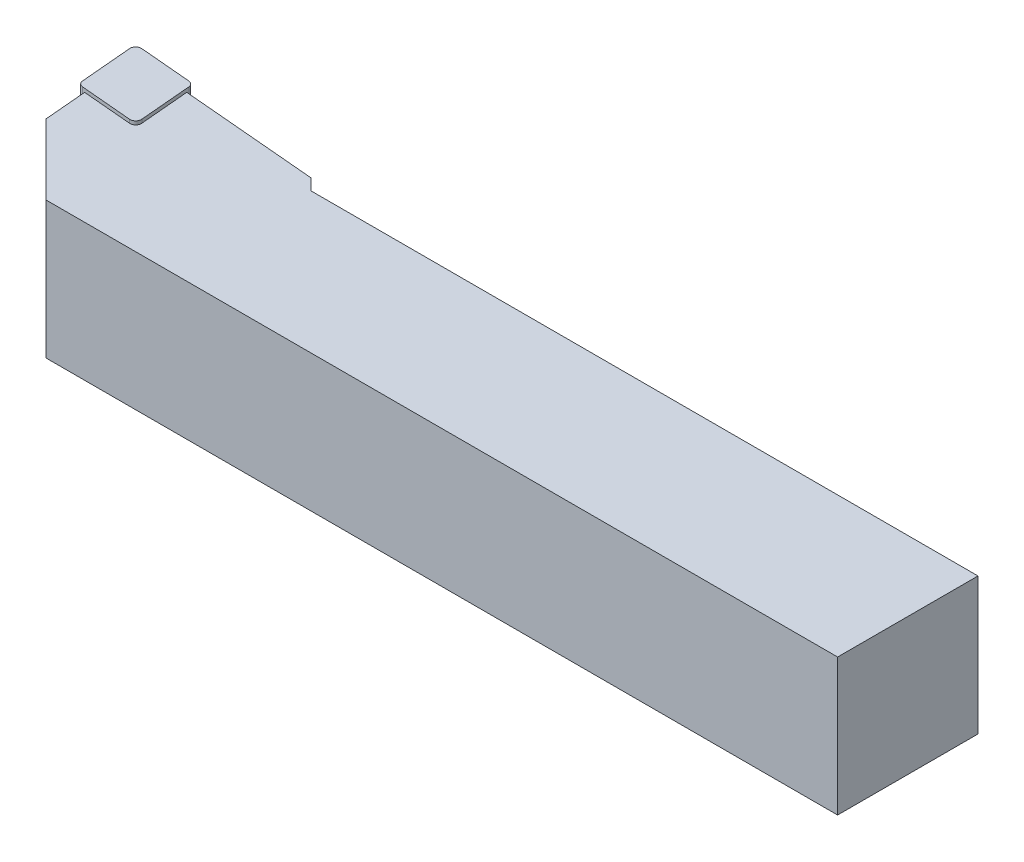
ISO-10303-21;
HEADER;
FILE_DESCRIPTION(('STEP AP214'),'2;1');
FILE_NAME('part.step','',(''),(''),'','','');
FILE_SCHEMA(('AUTOMOTIVE_DESIGN { 1 0 10303 214 1 1 1 1 }'));
ENDSEC;
DATA;
#1=APPLICATION_CONTEXT('core data for automotive mechanical design processes');
#2=APPLICATION_PROTOCOL_DEFINITION('international standard','automotive_design',2000,#1);
#3=PRODUCT_CONTEXT('',#1,'mechanical');
#4=PRODUCT('Part','Part','',(#3));
#5=PRODUCT_RELATED_PRODUCT_CATEGORY('part','',(#4));
#6=PRODUCT_DEFINITION_FORMATION('','',#4);
#7=PRODUCT_DEFINITION_CONTEXT('part definition',#1,'design');
#8=PRODUCT_DEFINITION('design','',#6,#7);
#9=PRODUCT_DEFINITION_SHAPE('','',#8);
#10=(LENGTH_UNIT() NAMED_UNIT(*) SI_UNIT(.MILLI.,.METRE.));
#11=(NAMED_UNIT(*) PLANE_ANGLE_UNIT() SI_UNIT($,.RADIAN.));
#12=(NAMED_UNIT(*) SI_UNIT($,.STERADIAN.) SOLID_ANGLE_UNIT());
#13=UNCERTAINTY_MEASURE_WITH_UNIT(LENGTH_MEASURE(1.E-05),#10,'distance_accuracy_value','');
#14=(GEOMETRIC_REPRESENTATION_CONTEXT(3) GLOBAL_UNCERTAINTY_ASSIGNED_CONTEXT((#13)) GLOBAL_UNIT_ASSIGNED_CONTEXT((#10,
#11,#12)) REPRESENTATION_CONTEXT('',''));
#15=CARTESIAN_POINT('',(0.,0.,0.));
#16=DIRECTION('',(0.,0.,1.));
#17=DIRECTION('',(1.,0.,0.));
#18=AXIS2_PLACEMENT_3D('',#15,#16,#17);
#19=CARTESIAN_POINT('',(0.800000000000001,-4.76,0.8));
#20=DIRECTION('',(0.,1.,0.));
#21=DIRECTION('',(0.,0.,1.));
#22=AXIS2_PLACEMENT_3D('',#19,#20,#21);
#23=CYLINDRICAL_SURFACE('',#22,0.8);
#24=CARTESIAN_POINT('',(0.800000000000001,0.,0.8));
#25=DIRECTION('',(0.,1.,0.));
#26=DIRECTION('',(0.,0.,1.));
#27=AXIS2_PLACEMENT_3D('',#24,#25,#26);
#28=CIRCLE('',#27,0.8);
#29=CARTESIAN_POINT('',(0.869724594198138,0.,0.00304424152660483));
#30=VERTEX_POINT('',#29);
#31=CARTESIAN_POINT('',(0.0030442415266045,0.,0.869724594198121));
#32=VERTEX_POINT('',#31);
#33=EDGE_CURVE('E137',#30,#32,#28,.T.);
#34=ORIENTED_EDGE('',*,*,#33,.F.);
#35=DIRECTION('',(0.,1.,0.));
#36=VECTOR('',#35,1.);
#37=CARTESIAN_POINT('',(0.869724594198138,-4.76,0.00304424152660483));
#38=LINE('',#37,#36);
#39=CARTESIAN_POINT('',(0.869724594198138,-4.76,0.00304424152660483));
#40=VERTEX_POINT('',#39);
#41=EDGE_CURVE('E53',#40,#30,#38,.T.);
#42=ORIENTED_EDGE('',*,*,#41,.F.);
#43=CARTESIAN_POINT('',(0.800000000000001,-4.76,0.8));
#44=DIRECTION('',(0.,1.,0.));
#45=DIRECTION('',(0.,0.,1.));
#46=AXIS2_PLACEMENT_3D('',#43,#44,#45);
#47=CIRCLE('',#46,0.8);
#48=CARTESIAN_POINT('',(0.0030442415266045,-4.76,0.869724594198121));
#49=VERTEX_POINT('',#48);
#50=EDGE_CURVE('E159',#40,#49,#47,.T.);
#51=ORIENTED_EDGE('',*,*,#50,.T.);
#52=DIRECTION('',(0.,1.,0.));
#53=VECTOR('',#52,1.);
#54=CARTESIAN_POINT('',(0.0030442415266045,-4.76,0.869724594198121));
#55=LINE('',#54,#53);
#56=EDGE_CURVE('E92',#49,#32,#55,.T.);
#57=ORIENTED_EDGE('',*,*,#56,.T.);
#58=EDGE_LOOP('',(#34,#42,#51,#57));
#59=FACE_BOUND('',#58,.T.);
#60=ADVANCED_FACE('F30',(#59),#23,.T.);
#61=CARTESIAN_POINT('',(0.869724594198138,-4.76,0.00304424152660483));
#62=DIRECTION('',(0.0871557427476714,0.,-0.996194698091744));
#63=DIRECTION('',(-0.996194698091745,0.,-0.0871557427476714));
#64=AXIS2_PLACEMENT_3D('',#61,#62,#63);
#65=PLANE('',#64);
#66=DIRECTION('',(-0.996194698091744,0.,-0.0871557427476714));
#67=VECTOR('',#66,1.);
#68=CARTESIAN_POINT('',(0.869724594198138,0.,0.00304424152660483));
#69=LINE('',#68,#67);
#70=CARTESIAN_POINT('',(8.21697670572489,0.,0.645845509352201));
#71=VERTEX_POINT('',#70);
#72=EDGE_CURVE('E156',#71,#30,#69,.T.);
#73=ORIENTED_EDGE('',*,*,#72,.F.);
#74=DIRECTION('',(0.,1.,0.));
#75=VECTOR('',#74,1.);
#76=CARTESIAN_POINT('',(8.21697670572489,-4.76,0.645845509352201));
#77=LINE('',#76,#75);
#78=CARTESIAN_POINT('',(8.21697670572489,-4.76,0.645845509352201));
#79=VERTEX_POINT('',#78);
#80=EDGE_CURVE('E128',#79,#71,#77,.T.);
#81=ORIENTED_EDGE('',*,*,#80,.F.);
#82=DIRECTION('',(-0.996194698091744,0.,-0.0871557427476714));
#83=VECTOR('',#82,1.);
#84=CARTESIAN_POINT('',(0.869724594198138,-4.76,0.00304424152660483));
#85=LINE('',#84,#83);
#86=EDGE_CURVE('E132',#79,#40,#85,.T.);
#87=ORIENTED_EDGE('',*,*,#86,.T.);
#88=ORIENTED_EDGE('',*,*,#41,.T.);
#89=EDGE_LOOP('',(#73,#81,#87,#88));
#90=FACE_BOUND('',#89,.T.);
#91=ADVANCED_FACE('F332',(#90),#65,.T.);
#92=CARTESIAN_POINT('',(8.14725211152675,-4.76,1.4428012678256));
#93=DIRECTION('',(0.,1.,0.));
#94=DIRECTION('',(0.,0.,1.));
#95=AXIS2_PLACEMENT_3D('',#92,#93,#94);
#96=CYLINDRICAL_SURFACE('',#95,0.8);
#97=CARTESIAN_POINT('',(8.14725211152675,0.,1.4428012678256));
#98=DIRECTION('',(0.,1.,0.));
#99=DIRECTION('',(0.,0.,-1.));
#100=AXIS2_PLACEMENT_3D('',#97,#98,#99);
#101=CIRCLE('',#100,0.8);
#102=CARTESIAN_POINT('',(8.94420787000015,0.,1.37307667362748));
#103=VERTEX_POINT('',#102);
#104=EDGE_CURVE('E126',#103,#71,#101,.T.);
#105=ORIENTED_EDGE('',*,*,#104,.F.);
#106=DIRECTION('',(0.,1.,0.));
#107=VECTOR('',#106,1.);
#108=CARTESIAN_POINT('',(8.94420787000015,-4.76,1.37307667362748));
#109=LINE('',#108,#107);
#110=CARTESIAN_POINT('',(8.94420787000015,-4.76,1.37307667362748));
#111=VERTEX_POINT('',#110);
#112=EDGE_CURVE('E109',#111,#103,#109,.T.);
#113=ORIENTED_EDGE('',*,*,#112,.F.);
#114=CARTESIAN_POINT('',(8.14725211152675,-4.76,1.4428012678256));
#115=DIRECTION('',(0.,1.,0.));
#116=DIRECTION('',(0.,0.,-1.));
#117=AXIS2_PLACEMENT_3D('',#114,#115,#116);
#118=CIRCLE('',#117,0.8);
#119=EDGE_CURVE('E118',#111,#79,#118,.T.);
#120=ORIENTED_EDGE('',*,*,#119,.T.);
#121=ORIENTED_EDGE('',*,*,#80,.T.);
#122=EDGE_LOOP('',(#105,#113,#120,#121));
#123=FACE_BOUND('',#122,.T.);
#124=ADVANCED_FACE('F123',(#123),#96,.T.);
#125=CARTESIAN_POINT('',(8.94420787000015,-4.76,1.37307667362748));
#126=DIRECTION('',(0.996194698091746,0.,-0.0871557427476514));
#127=DIRECTION('',(-0.0871557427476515,0.,-0.996194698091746));
#128=AXIS2_PLACEMENT_3D('',#125,#126,#127);
#129=PLANE('',#128);
#130=DIRECTION('',(0.,1.,0.));
#131=VECTOR('',#130,1.);
#132=CARTESIAN_POINT('',(8.97259223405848,-4.76,1.69751143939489));
#133=LINE('',#132,#131);
#134=CARTESIAN_POINT('',(8.97259223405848,-4.76,1.69751143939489));
#135=VERTEX_POINT('',#134);
#136=CARTESIAN_POINT('',(8.97259223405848,-0.5,1.69751143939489));
#137=VERTEX_POINT('',#136);
#138=EDGE_CURVE('E114',#135,#137,#133,.T.);
#139=ORIENTED_EDGE('',*,*,#138,.F.);
#140=DIRECTION('',(-0.0871557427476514,0.,-0.996194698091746));
#141=VECTOR('',#140,1.);
#142=CARTESIAN_POINT('',(8.94420787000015,-4.76,1.37307667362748));
#143=LINE('',#142,#141);
#144=EDGE_CURVE('E105',#135,#111,#143,.T.);
#145=ORIENTED_EDGE('',*,*,#144,.T.);
#146=ORIENTED_EDGE('',*,*,#112,.T.);
#147=DIRECTION('',(-0.0871557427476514,0.,-0.996194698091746));
#148=VECTOR('',#147,1.);
#149=CARTESIAN_POINT('',(8.94420787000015,0.,1.37307667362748));
#150=LINE('',#149,#148);
#151=CARTESIAN_POINT('',(9.58700913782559,0.,8.72032878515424));
#152=VERTEX_POINT('',#151);
#153=EDGE_CURVE('E153',#152,#103,#150,.T.);
#154=ORIENTED_EDGE('',*,*,#153,.F.);
#155=DIRECTION('',(0.,1.,0.));
#156=VECTOR('',#155,1.);
#157=CARTESIAN_POINT('',(9.58700913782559,-4.76,8.72032878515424));
#158=LINE('',#157,#156);
#159=CARTESIAN_POINT('',(9.58700913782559,-0.5,8.72032878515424));
#160=VERTEX_POINT('',#159);
#161=EDGE_CURVE('E129',#160,#152,#158,.T.);
#162=ORIENTED_EDGE('',*,*,#161,.F.);
#163=DIRECTION('',(0.0871557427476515,0.,0.996194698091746));
#164=VECTOR('',#163,1.);
#165=CARTESIAN_POINT('',(8.94420787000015,-0.5,1.37307667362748));
#166=LINE('',#165,#164);
#167=EDGE_CURVE('E141',#137,#160,#166,.T.);
#168=ORIENTED_EDGE('',*,*,#167,.F.);
#169=EDGE_LOOP('',(#139,#145,#146,#154,#162,#168));
#170=FACE_BOUND('',#169,.T.);
#171=ADVANCED_FACE('F107',(#170),#129,.T.);
#172=CARTESIAN_POINT('',(8.7900533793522,-4.76,8.79005337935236));
#173=DIRECTION('',(0.,1.,0.));
#174=DIRECTION('',(0.,0.,1.));
#175=AXIS2_PLACEMENT_3D('',#172,#173,#174);
#176=CYLINDRICAL_SURFACE('',#175,0.8);
#177=CARTESIAN_POINT('',(8.7900533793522,-0.5,8.79005337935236));
#178=DIRECTION('',(0.,1.,0.));
#179=DIRECTION('',(0.,0.,1.));
#180=AXIS2_PLACEMENT_3D('',#177,#178,#179);
#181=CIRCLE('',#180,0.8);
#182=CARTESIAN_POINT('',(8.72032878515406,-0.5,9.58700913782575));
#183=VERTEX_POINT('',#182);
#184=EDGE_CURVE('E196',#160,#183,#181,.F.);
#185=ORIENTED_EDGE('',*,*,#184,.F.);
#186=ORIENTED_EDGE('',*,*,#161,.T.);
#187=CARTESIAN_POINT('',(8.7900533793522,0.,8.79005337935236));
#188=DIRECTION('',(0.,1.,0.));
#189=DIRECTION('',(0.,0.,-1.));
#190=AXIS2_PLACEMENT_3D('',#187,#188,#189);
#191=CIRCLE('',#190,0.8);
#192=CARTESIAN_POINT('',(8.72032878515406,0.,9.58700913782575));
#193=VERTEX_POINT('',#192);
#194=EDGE_CURVE('E150',#193,#152,#191,.T.);
#195=ORIENTED_EDGE('',*,*,#194,.F.);
#196=DIRECTION('',(0.,1.,0.));
#197=VECTOR('',#196,1.);
#198=CARTESIAN_POINT('',(8.72032878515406,-4.76,9.58700913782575));
#199=LINE('',#198,#197);
#200=EDGE_CURVE('E164',#183,#193,#199,.T.);
#201=ORIENTED_EDGE('',*,*,#200,.F.);
#202=EDGE_LOOP('',(#185,#186,#195,#201));
#203=FACE_BOUND('',#202,.T.);
#204=ADVANCED_FACE('F324',(#203),#176,.T.);
#205=CARTESIAN_POINT('',(8.72032878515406,-4.76,9.58700913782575));
#206=DIRECTION('',(-0.0871557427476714,0.,0.996194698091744));
#207=DIRECTION('',(0.996194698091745,0.,0.0871557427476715));
#208=AXIS2_PLACEMENT_3D('',#205,#206,#207);
#209=PLANE('',#208);
#210=DIRECTION('',(0.,-1.,0.));
#211=VECTOR('',#210,1.);
#212=CARTESIAN_POINT('',(1.69751143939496,-4.76,8.97259223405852));
#213=LINE('',#212,#211);
#214=CARTESIAN_POINT('',(1.69751143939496,-0.5,8.97259223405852));
#215=VERTEX_POINT('',#214);
#216=CARTESIAN_POINT('',(1.69751143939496,-4.76,8.97259223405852));
#217=VERTEX_POINT('',#216);
#218=EDGE_CURVE('E186',#215,#217,#213,.T.);
#219=ORIENTED_EDGE('',*,*,#218,.F.);
#220=DIRECTION('',(-0.996194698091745,0.,-0.0871557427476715));
#221=VECTOR('',#220,1.);
#222=CARTESIAN_POINT('',(8.72032878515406,-0.5,9.58700913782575));
#223=LINE('',#222,#221);
#224=EDGE_CURVE('E11',#183,#215,#223,.T.);
#225=ORIENTED_EDGE('',*,*,#224,.F.);
#226=ORIENTED_EDGE('',*,*,#200,.T.);
#227=DIRECTION('',(0.996194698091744,0.,0.0871557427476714));
#228=VECTOR('',#227,1.);
#229=CARTESIAN_POINT('',(8.72032878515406,0.,9.58700913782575));
#230=LINE('',#229,#228);
#231=CARTESIAN_POINT('',(1.37307667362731,0.,8.94420787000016));
#232=VERTEX_POINT('',#231);
#233=EDGE_CURVE('E147',#232,#193,#230,.T.);
#234=ORIENTED_EDGE('',*,*,#233,.F.);
#235=DIRECTION('',(0.,1.,0.));
#236=VECTOR('',#235,1.);
#237=CARTESIAN_POINT('',(1.37307667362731,-4.76,8.94420787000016));
#238=LINE('',#237,#236);
#239=CARTESIAN_POINT('',(1.37307667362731,-4.76,8.94420787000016));
#240=VERTEX_POINT('',#239);
#241=EDGE_CURVE('E166',#240,#232,#238,.T.);
#242=ORIENTED_EDGE('',*,*,#241,.F.);
#243=DIRECTION('',(0.996194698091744,0.,0.0871557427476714));
#244=VECTOR('',#243,1.);
#245=CARTESIAN_POINT('',(8.72032878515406,-4.76,9.58700913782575));
#246=LINE('',#245,#244);
#247=EDGE_CURVE('E119',#240,#217,#246,.T.);
#248=ORIENTED_EDGE('',*,*,#247,.T.);
#249=EDGE_LOOP('',(#219,#225,#226,#234,#242,#248));
#250=FACE_BOUND('',#249,.T.);
#251=ADVANCED_FACE('F184',(#250),#209,.T.);
#252=CARTESIAN_POINT('',(1.44280126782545,-4.76,8.14725211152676));
#253=DIRECTION('',(0.,1.,0.));
#254=DIRECTION('',(0.,0.,1.));
#255=AXIS2_PLACEMENT_3D('',#252,#253,#254);
#256=CYLINDRICAL_SURFACE('',#255,0.8);
#257=CARTESIAN_POINT('',(1.44280126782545,0.,8.14725211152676));
#258=DIRECTION('',(0.,1.,0.));
#259=DIRECTION('',(0.,0.,-1.));
#260=AXIS2_PLACEMENT_3D('',#257,#258,#259);
#261=CIRCLE('',#260,0.8);
#262=CARTESIAN_POINT('',(0.645845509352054,0.,8.21697670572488));
#263=VERTEX_POINT('',#262);
#264=EDGE_CURVE('E144',#263,#232,#261,.T.);
#265=ORIENTED_EDGE('',*,*,#264,.F.);
#266=DIRECTION('',(0.,1.,0.));
#267=VECTOR('',#266,1.);
#268=CARTESIAN_POINT('',(0.645845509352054,-4.76,8.21697670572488));
#269=LINE('',#268,#267);
#270=CARTESIAN_POINT('',(0.645845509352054,-4.76,8.21697670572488));
#271=VERTEX_POINT('',#270);
#272=EDGE_CURVE('E168',#271,#263,#269,.T.);
#273=ORIENTED_EDGE('',*,*,#272,.F.);
#274=CARTESIAN_POINT('',(1.44280126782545,-4.76,8.14725211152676));
#275=DIRECTION('',(0.,1.,0.));
#276=DIRECTION('',(0.,0.,-1.));
#277=AXIS2_PLACEMENT_3D('',#274,#275,#276);
#278=CIRCLE('',#277,0.8);
#279=EDGE_CURVE('E188',#271,#240,#278,.T.);
#280=ORIENTED_EDGE('',*,*,#279,.T.);
#281=ORIENTED_EDGE('',*,*,#241,.T.);
#282=EDGE_LOOP('',(#265,#273,#280,#281));
#283=FACE_BOUND('',#282,.T.);
#284=ADVANCED_FACE('F330',(#283),#256,.T.);
#285=CARTESIAN_POINT('',(0.645845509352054,-4.76,8.21697670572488));
#286=DIRECTION('',(-0.996194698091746,0.,0.0871557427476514));
#287=DIRECTION('',(0.0871557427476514,0.,0.996194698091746));
#288=AXIS2_PLACEMENT_3D('',#285,#286,#287);
#289=PLANE('',#288);
#290=DIRECTION('',(0.0871557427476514,0.,0.996194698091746));
#291=VECTOR('',#290,1.);
#292=CARTESIAN_POINT('',(0.645845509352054,0.,8.21697670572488));
#293=LINE('',#292,#291);
#294=EDGE_CURVE('E140',#32,#263,#293,.T.);
#295=ORIENTED_EDGE('',*,*,#294,.F.);
#296=ORIENTED_EDGE('',*,*,#56,.F.);
#297=DIRECTION('',(0.0871557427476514,0.,0.996194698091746));
#298=VECTOR('',#297,1.);
#299=CARTESIAN_POINT('',(0.645845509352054,-4.76,8.21697670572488));
#300=LINE('',#299,#298);
#301=EDGE_CURVE('E189',#49,#271,#300,.T.);
#302=ORIENTED_EDGE('',*,*,#301,.T.);
#303=ORIENTED_EDGE('',*,*,#272,.T.);
#304=EDGE_LOOP('',(#295,#296,#302,#303));
#305=FACE_BOUND('',#304,.T.);
#306=ADVANCED_FACE('F331',(#305),#289,.T.);
#307=CARTESIAN_POINT('',(0.800000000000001,-4.76,0.8));
#308=DIRECTION('',(0.,1.,0.));
#309=DIRECTION('',(0.,0.,1.));
#310=AXIS2_PLACEMENT_3D('',#307,#308,#309);
#311=PLANE('',#310);
#312=DIRECTION('',(-0.996194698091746,0.,-0.0871557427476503));
#313=VECTOR('',#312,1.);
#314=CARTESIAN_POINT('',(0.784154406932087,-4.76,0.981115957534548));
#315=LINE('',#314,#313);
#316=CARTESIAN_POINT('',(0.999999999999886,-4.76,1.00000000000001));
#317=VERTEX_POINT('',#316);
#318=EDGE_CURVE('E161',#135,#317,#315,.T.);
#319=ORIENTED_EDGE('',*,*,#318,.T.);
#320=DIRECTION('',(0.0871557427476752,0.,0.996194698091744));
#321=VECTOR('',#320,1.);
#322=CARTESIAN_POINT('',(0.98111595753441,-4.76,0.784154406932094));
#323=LINE('',#322,#321);
#324=EDGE_CURVE('E37',#317,#217,#323,.T.);
#325=ORIENTED_EDGE('',*,*,#324,.T.);
#326=ORIENTED_EDGE('',*,*,#247,.F.);
#327=ORIENTED_EDGE('',*,*,#279,.F.);
#328=ORIENTED_EDGE('',*,*,#301,.F.);
#329=ORIENTED_EDGE('',*,*,#50,.F.);
#330=ORIENTED_EDGE('',*,*,#86,.F.);
#331=ORIENTED_EDGE('',*,*,#119,.F.);
#332=ORIENTED_EDGE('',*,*,#144,.F.);
#333=EDGE_LOOP('',(#319,#325,#326,#327,#328,#329,#330,#331,#332));
#334=FACE_BOUND('',#333,.T.);
#335=ADVANCED_FACE('F131',(#334),#311,.F.);
#336=CARTESIAN_POINT('',(0.800000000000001,0.,0.8));
#337=DIRECTION('',(0.,1.,0.));
#338=DIRECTION('',(0.,0.,1.));
#339=AXIS2_PLACEMENT_3D('',#336,#337,#338);
#340=PLANE('',#339);
#341=ORIENTED_EDGE('',*,*,#33,.T.);
#342=ORIENTED_EDGE('',*,*,#294,.T.);
#343=ORIENTED_EDGE('',*,*,#264,.T.);
#344=ORIENTED_EDGE('',*,*,#233,.T.);
#345=ORIENTED_EDGE('',*,*,#194,.T.);
#346=ORIENTED_EDGE('',*,*,#153,.T.);
#347=ORIENTED_EDGE('',*,*,#104,.T.);
#348=ORIENTED_EDGE('',*,*,#72,.T.);
#349=EDGE_LOOP('',(#341,#342,#343,#344,#345,#346,#347,#348));
#350=FACE_BOUND('',#349,.T.);
#351=ADVANCED_FACE('F327',(#350),#340,.T.);
#352=CARTESIAN_POINT('',(125.,-20.,5.));
#353=DIRECTION('',(0.,0.,-1.));
#354=DIRECTION('',(-1.,0.,0.));
#355=AXIS2_PLACEMENT_3D('',#352,#353,#354);
#356=PLANE('',#355);
#357=DIRECTION('',(-1.,0.,0.));
#358=VECTOR('',#357,1.);
#359=CARTESIAN_POINT('',(125.,-0.5,5.));
#360=LINE('',#359,#358);
#361=CARTESIAN_POINT('',(125.,-0.5,5.));
#362=VERTEX_POINT('',#361);
#363=CARTESIAN_POINT('',(30.,-0.5,5.));
#364=VERTEX_POINT('',#363);
#365=EDGE_CURVE('E240',#362,#364,#360,.T.);
#366=ORIENTED_EDGE('',*,*,#365,.F.);
#367=DIRECTION('',(0.,1.,0.));
#368=VECTOR('',#367,1.);
#369=CARTESIAN_POINT('',(125.,-20.,5.));
#370=LINE('',#369,#368);
#371=CARTESIAN_POINT('',(125.,-20.,5.));
#372=VERTEX_POINT('',#371);
#373=EDGE_CURVE('E201',#372,#362,#370,.T.);
#374=ORIENTED_EDGE('',*,*,#373,.F.);
#375=DIRECTION('',(-1.,0.,0.));
#376=VECTOR('',#375,1.);
#377=CARTESIAN_POINT('',(125.,-20.,5.));
#378=LINE('',#377,#376);
#379=CARTESIAN_POINT('',(30.,-20.,5.));
#380=VERTEX_POINT('',#379);
#381=EDGE_CURVE('E224',#372,#380,#378,.T.);
#382=ORIENTED_EDGE('',*,*,#381,.T.);
#383=DIRECTION('',(0.,1.,0.));
#384=VECTOR('',#383,1.);
#385=CARTESIAN_POINT('',(30.,-20.,5.));
#386=LINE('',#385,#384);
#387=EDGE_CURVE('E202',#380,#364,#386,.T.);
#388=ORIENTED_EDGE('',*,*,#387,.T.);
#389=EDGE_LOOP('',(#366,#374,#382,#388));
#390=FACE_BOUND('',#389,.T.);
#391=ADVANCED_FACE('F265',(#390),#356,.T.);
#392=CARTESIAN_POINT('',(125.,-20.,5.));
#393=DIRECTION('',(1.,0.,0.));
#394=DIRECTION('',(0.,0.,-1.));
#395=AXIS2_PLACEMENT_3D('',#392,#393,#394);
#396=PLANE('',#395);
#397=DIRECTION('',(0.,0.,-1.));
#398=VECTOR('',#397,1.);
#399=CARTESIAN_POINT('',(125.,-0.5,5.));
#400=LINE('',#399,#398);
#401=CARTESIAN_POINT('',(125.,-0.5,25.));
#402=VERTEX_POINT('',#401);
#403=EDGE_CURVE('E221',#402,#362,#400,.T.);
#404=ORIENTED_EDGE('',*,*,#403,.F.);
#405=DIRECTION('',(0.,1.,0.));
#406=VECTOR('',#405,1.);
#407=CARTESIAN_POINT('',(125.,-20.,25.));
#408=LINE('',#407,#406);
#409=CARTESIAN_POINT('',(125.,-20.,25.));
#410=VERTEX_POINT('',#409);
#411=EDGE_CURVE('E216',#410,#402,#408,.T.);
#412=ORIENTED_EDGE('',*,*,#411,.F.);
#413=DIRECTION('',(0.,0.,-1.));
#414=VECTOR('',#413,1.);
#415=CARTESIAN_POINT('',(125.,-20.,5.));
#416=LINE('',#415,#414);
#417=EDGE_CURVE('E206',#410,#372,#416,.T.);
#418=ORIENTED_EDGE('',*,*,#417,.T.);
#419=ORIENTED_EDGE('',*,*,#373,.T.);
#420=EDGE_LOOP('',(#404,#412,#418,#419));
#421=FACE_BOUND('',#420,.T.);
#422=ADVANCED_FACE('F285',(#421),#396,.T.);
#423=CARTESIAN_POINT('',(125.,-20.,25.));
#424=DIRECTION('',(0.,0.,1.));
#425=DIRECTION('',(1.,0.,0.));
#426=AXIS2_PLACEMENT_3D('',#423,#424,#425);
#427=PLANE('',#426);
#428=DIRECTION('',(1.,0.,0.));
#429=VECTOR('',#428,1.);
#430=CARTESIAN_POINT('',(125.,-0.5,25.));
#431=LINE('',#430,#429);
#432=CARTESIAN_POINT('',(12.2248412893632,-0.5,25.));
#433=VERTEX_POINT('',#432);
#434=EDGE_CURVE('E225',#433,#402,#431,.T.);
#435=ORIENTED_EDGE('',*,*,#434,.F.);
#436=DIRECTION('',(0.,1.,0.));
#437=VECTOR('',#436,1.);
#438=CARTESIAN_POINT('',(12.2248412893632,-20.,25.));
#439=LINE('',#438,#437);
#440=CARTESIAN_POINT('',(12.2248412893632,-20.,25.));
#441=VERTEX_POINT('',#440);
#442=EDGE_CURVE('E213',#441,#433,#439,.T.);
#443=ORIENTED_EDGE('',*,*,#442,.F.);
#444=DIRECTION('',(1.,0.,0.));
#445=VECTOR('',#444,1.);
#446=CARTESIAN_POINT('',(125.,-20.,25.));
#447=LINE('',#446,#445);
#448=EDGE_CURVE('E245',#441,#410,#447,.T.);
#449=ORIENTED_EDGE('',*,*,#448,.T.);
#450=ORIENTED_EDGE('',*,*,#411,.T.);
#451=EDGE_LOOP('',(#435,#443,#449,#450));
#452=FACE_BOUND('',#451,.T.);
#453=ADVANCED_FACE('F292',(#452),#427,.T.);
#454=CARTESIAN_POINT('',(2.22484128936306,-20.,15.));
#455=DIRECTION('',(-0.707106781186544,0.,0.707106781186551));
#456=DIRECTION('',(0.707106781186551,0.,0.707106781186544));
#457=AXIS2_PLACEMENT_3D('',#454,#455,#456);
#458=PLANE('',#457);
#459=DIRECTION('',(0.707106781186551,0.,0.707106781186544));
#460=VECTOR('',#459,1.);
#461=CARTESIAN_POINT('',(2.22484128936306,-0.5,15.));
#462=LINE('',#461,#460);
#463=CARTESIAN_POINT('',(2.22484128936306,-0.5,15.));
#464=VERTEX_POINT('',#463);
#465=EDGE_CURVE('E228',#464,#433,#462,.T.);
#466=ORIENTED_EDGE('',*,*,#465,.F.);
#467=DIRECTION('',(0.,1.,0.));
#468=VECTOR('',#467,1.);
#469=CARTESIAN_POINT('',(2.22484128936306,-20.,15.));
#470=LINE('',#469,#468);
#471=CARTESIAN_POINT('',(2.22484128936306,-20.,15.));
#472=VERTEX_POINT('',#471);
#473=EDGE_CURVE('E210',#472,#464,#470,.T.);
#474=ORIENTED_EDGE('',*,*,#473,.F.);
#475=DIRECTION('',(0.707106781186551,0.,0.707106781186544));
#476=VECTOR('',#475,1.);
#477=CARTESIAN_POINT('',(2.22484128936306,-20.,15.));
#478=LINE('',#477,#476);
#479=EDGE_CURVE('E248',#472,#441,#478,.T.);
#480=ORIENTED_EDGE('',*,*,#479,.T.);
#481=ORIENTED_EDGE('',*,*,#442,.T.);
#482=EDGE_LOOP('',(#466,#474,#480,#481));
#483=FACE_BOUND('',#482,.T.);
#484=ADVANCED_FACE('F300',(#483),#458,.T.);
#485=CARTESIAN_POINT('',(0.999999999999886,-20.,1.00000000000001));
#486=DIRECTION('',(-0.996194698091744,0.,0.0871557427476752));
#487=DIRECTION('',(0.0871557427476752,0.,0.996194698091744));
#488=AXIS2_PLACEMENT_3D('',#485,#486,#487);
#489=PLANE('',#488);
#490=DIRECTION('',(0.0871557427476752,0.,0.996194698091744));
#491=VECTOR('',#490,1.);
#492=CARTESIAN_POINT('',(0.999999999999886,-0.5,1.00000000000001));
#493=LINE('',#492,#491);
#494=EDGE_CURVE('E231',#215,#464,#493,.T.);
#495=ORIENTED_EDGE('',*,*,#494,.F.);
#496=ORIENTED_EDGE('',*,*,#218,.T.);
#497=ORIENTED_EDGE('',*,*,#324,.F.);
#498=DIRECTION('',(0.,1.,0.));
#499=VECTOR('',#498,1.);
#500=CARTESIAN_POINT('',(0.999999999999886,-20.,1.00000000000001));
#501=LINE('',#500,#499);
#502=CARTESIAN_POINT('',(0.999999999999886,-20.,1.00000000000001));
#503=VERTEX_POINT('',#502);
#504=EDGE_CURVE('E44',#503,#317,#501,.T.);
#505=ORIENTED_EDGE('',*,*,#504,.F.);
#506=DIRECTION('',(0.0871557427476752,0.,0.996194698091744));
#507=VECTOR('',#506,1.);
#508=CARTESIAN_POINT('',(0.999999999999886,-20.,1.00000000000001));
#509=LINE('',#508,#507);
#510=EDGE_CURVE('E251',#503,#472,#509,.T.);
#511=ORIENTED_EDGE('',*,*,#510,.T.);
#512=ORIENTED_EDGE('',*,*,#473,.T.);
#513=EDGE_LOOP('',(#495,#496,#497,#505,#511,#512));
#514=FACE_BOUND('',#513,.T.);
#515=ADVANCED_FACE('F306',(#514),#489,.T.);
#516=CARTESIAN_POINT('',(0.999999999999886,-20.,1.00000000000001));
#517=DIRECTION('',(0.0871557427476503,0.,-0.996194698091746));
#518=DIRECTION('',(-0.996194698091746,0.,-0.0871557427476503));
#519=AXIS2_PLACEMENT_3D('',#516,#517,#518);
#520=PLANE('',#519);
#521=ORIENTED_EDGE('',*,*,#318,.F.);
#522=ORIENTED_EDGE('',*,*,#138,.T.);
#523=DIRECTION('',(-0.996194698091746,0.,-0.0871557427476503));
#524=VECTOR('',#523,1.);
#525=CARTESIAN_POINT('',(0.999999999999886,-0.5,1.00000000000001));
#526=LINE('',#525,#524);
#527=CARTESIAN_POINT('',(28.3969199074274,-0.5,3.39691990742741));
#528=VERTEX_POINT('',#527);
#529=EDGE_CURVE('E234',#528,#137,#526,.T.);
#530=ORIENTED_EDGE('',*,*,#529,.F.);
#531=DIRECTION('',(0.,1.,0.));
#532=VECTOR('',#531,1.);
#533=CARTESIAN_POINT('',(28.3969199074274,-20.,3.39691990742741));
#534=LINE('',#533,#532);
#535=CARTESIAN_POINT('',(28.3969199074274,-20.,3.39691990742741));
#536=VERTEX_POINT('',#535);
#537=EDGE_CURVE('E205',#536,#528,#534,.T.);
#538=ORIENTED_EDGE('',*,*,#537,.F.);
#539=DIRECTION('',(-0.996194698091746,0.,-0.0871557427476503));
#540=VECTOR('',#539,1.);
#541=CARTESIAN_POINT('',(0.999999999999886,-20.,1.00000000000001));
#542=LINE('',#541,#540);
#543=EDGE_CURVE('E254',#536,#503,#542,.T.);
#544=ORIENTED_EDGE('',*,*,#543,.T.);
#545=ORIENTED_EDGE('',*,*,#504,.T.);
#546=EDGE_LOOP('',(#521,#522,#530,#538,#544,#545));
#547=FACE_BOUND('',#546,.T.);
#548=ADVANCED_FACE('F363',(#547),#520,.T.);
#549=CARTESIAN_POINT('',(30.,-20.,5.));
#550=DIRECTION('',(0.707106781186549,0.,-0.707106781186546));
#551=DIRECTION('',(-0.707106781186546,0.,-0.707106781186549));
#552=AXIS2_PLACEMENT_3D('',#549,#550,#551);
#553=PLANE('',#552);
#554=DIRECTION('',(-0.707106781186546,0.,-0.707106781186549));
#555=VECTOR('',#554,1.);
#556=CARTESIAN_POINT('',(30.,-0.5,5.));
#557=LINE('',#556,#555);
#558=EDGE_CURVE('E237',#364,#528,#557,.T.);
#559=ORIENTED_EDGE('',*,*,#558,.F.);
#560=ORIENTED_EDGE('',*,*,#387,.F.);
#561=DIRECTION('',(-0.707106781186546,0.,-0.707106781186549));
#562=VECTOR('',#561,1.);
#563=CARTESIAN_POINT('',(30.,-20.,5.));
#564=LINE('',#563,#562);
#565=EDGE_CURVE('E256',#380,#536,#564,.T.);
#566=ORIENTED_EDGE('',*,*,#565,.T.);
#567=ORIENTED_EDGE('',*,*,#537,.T.);
#568=EDGE_LOOP('',(#559,#560,#566,#567));
#569=FACE_BOUND('',#568,.T.);
#570=ADVANCED_FACE('F360',(#569),#553,.T.);
#571=CARTESIAN_POINT('',(125.,-20.,5.));
#572=DIRECTION('',(0.,1.,0.));
#573=DIRECTION('',(0.,0.,1.));
#574=AXIS2_PLACEMENT_3D('',#571,#572,#573);
#575=PLANE('',#574);
#576=ORIENTED_EDGE('',*,*,#381,.F.);
#577=ORIENTED_EDGE('',*,*,#417,.F.);
#578=ORIENTED_EDGE('',*,*,#448,.F.);
#579=ORIENTED_EDGE('',*,*,#479,.F.);
#580=ORIENTED_EDGE('',*,*,#510,.F.);
#581=ORIENTED_EDGE('',*,*,#543,.F.);
#582=ORIENTED_EDGE('',*,*,#565,.F.);
#583=EDGE_LOOP('',(#576,#577,#578,#579,#580,#581,#582));
#584=FACE_BOUND('',#583,.T.);
#585=ADVANCED_FACE('F276',(#584),#575,.F.);
#586=CARTESIAN_POINT('',(125.,-0.5,5.));
#587=DIRECTION('',(0.,1.,0.));
#588=DIRECTION('',(0.,0.,1.));
#589=AXIS2_PLACEMENT_3D('',#586,#587,#588);
#590=PLANE('',#589);
#591=ORIENTED_EDGE('',*,*,#529,.T.);
#592=ORIENTED_EDGE('',*,*,#167,.T.);
#593=ORIENTED_EDGE('',*,*,#184,.T.);
#594=ORIENTED_EDGE('',*,*,#224,.T.);
#595=ORIENTED_EDGE('',*,*,#494,.T.);
#596=ORIENTED_EDGE('',*,*,#465,.T.);
#597=ORIENTED_EDGE('',*,*,#434,.T.);
#598=ORIENTED_EDGE('',*,*,#403,.T.);
#599=ORIENTED_EDGE('',*,*,#365,.T.);
#600=ORIENTED_EDGE('',*,*,#558,.T.);
#601=EDGE_LOOP('',(#591,#592,#593,#594,#595,#596,#597,#598,#599,#600));
#602=FACE_BOUND('',#601,.T.);
#603=ADVANCED_FACE('F319',(#602),#590,.T.);
#604=CLOSED_SHELL('',(#60,#91,#124,#171,#204,#251,#284,#306,#335,#351,#391,#422,#453,#484,#515,
#548,#570,#585,#603));
#605=MANIFOLD_SOLID_BREP('B2',#604);
#606=ADVANCED_BREP_SHAPE_REPRESENTATION('',(#18,#605),#14);
#607=SHAPE_DEFINITION_REPRESENTATION(#9,#606);
ENDSEC;
END-ISO-10303-21;
